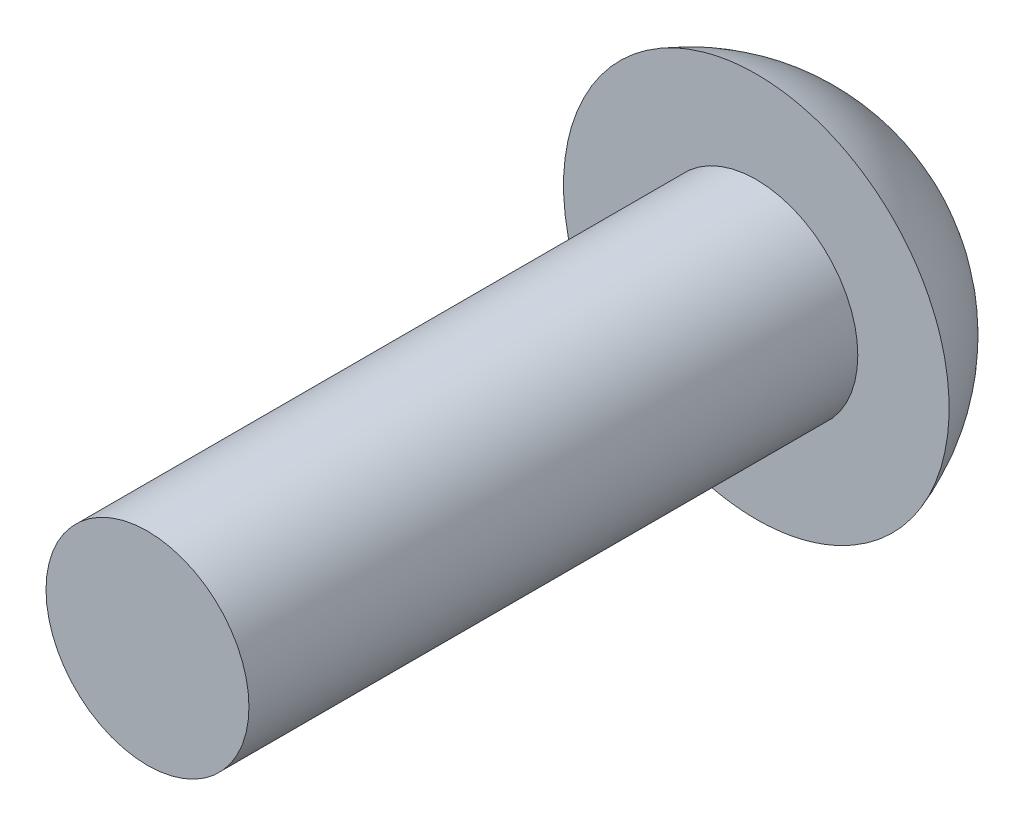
ISO-10303-21;
HEADER;
FILE_DESCRIPTION(('STEP AP214'),'2;1');
FILE_NAME('part.step','',(''),(''),'','','');
FILE_SCHEMA(('AUTOMOTIVE_DESIGN { 1 0 10303 214 1 1 1 1 }'));
ENDSEC;
DATA;
#1=APPLICATION_CONTEXT('core data for automotive mechanical design processes');
#2=APPLICATION_PROTOCOL_DEFINITION('international standard','automotive_design',2000,#1);
#3=PRODUCT_CONTEXT('',#1,'mechanical');
#4=PRODUCT('Part','Part','',(#3));
#5=PRODUCT_RELATED_PRODUCT_CATEGORY('part','',(#4));
#6=PRODUCT_DEFINITION_FORMATION('','',#4);
#7=PRODUCT_DEFINITION_CONTEXT('part definition',#1,'design');
#8=PRODUCT_DEFINITION('design','',#6,#7);
#9=PRODUCT_DEFINITION_SHAPE('','',#8);
#10=(LENGTH_UNIT() NAMED_UNIT(*) SI_UNIT(.MILLI.,.METRE.));
#11=(NAMED_UNIT(*) PLANE_ANGLE_UNIT() SI_UNIT($,.RADIAN.));
#12=(NAMED_UNIT(*) SI_UNIT($,.STERADIAN.) SOLID_ANGLE_UNIT());
#13=UNCERTAINTY_MEASURE_WITH_UNIT(LENGTH_MEASURE(1.E-05),#10,'distance_accuracy_value','');
#14=(GEOMETRIC_REPRESENTATION_CONTEXT(3) GLOBAL_UNCERTAINTY_ASSIGNED_CONTEXT((#13)) GLOBAL_UNIT_ASSIGNED_CONTEXT((#10,
#11,#12)) REPRESENTATION_CONTEXT('',''));
#15=CARTESIAN_POINT('',(0.,0.,0.));
#16=DIRECTION('',(0.,0.,1.));
#17=DIRECTION('',(1.,0.,0.));
#18=AXIS2_PLACEMENT_3D('',#15,#16,#17);
#19=CARTESIAN_POINT('',(17.7086633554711,79.2234218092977,-9.5));
#20=DIRECTION('',(0.,0.,-1.));
#21=DIRECTION('',(-1.,0.,0.));
#22=AXIS2_PLACEMENT_3D('',#19,#20,#21);
#23=PLANE('',#22);
#24=CARTESIAN_POINT('',(19.0714543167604,78.3494634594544,-9.5));
#25=DIRECTION('',(0.,0.,-1.));
#26=DIRECTION('',(0.,1.,0.));
#27=AXIS2_PLACEMENT_3D('',#24,#25,#26);
#28=CIRCLE('',#27,0.761601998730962);
#29=CARTESIAN_POINT('',(18.5018949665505,78.8550717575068,-9.5));
#30=VERTEX_POINT('',#29);
#31=CARTESIAN_POINT('',(19.6061955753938,78.8917635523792,-9.5));
#32=VERTEX_POINT('',#31);
#33=EDGE_CURVE('E107',#30,#32,#28,.T.);
#34=ORIENTED_EDGE('',*,*,#33,.F.);
#35=CARTESIAN_POINT('',(18.2440188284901,79.0839931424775,-9.5));
#36=DIRECTION('',(0.,0.,-1.));
#37=DIRECTION('',(0.,1.,0.));
#38=AXIS2_PLACEMENT_3D('',#35,#36,#37);
#39=CIRCLE('',#38,0.344826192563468);
#40=CARTESIAN_POINT('',(17.9103241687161,79.1709010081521,-9.5));
#41=VERTEX_POINT('',#40);
#42=EDGE_CURVE('E142',#30,#41,#39,.T.);
#43=ORIENTED_EDGE('',*,*,#42,.T.);
#44=CARTESIAN_POINT('',(17.1733078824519,79.3628504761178,-9.5));
#45=DIRECTION('',(0.,0.,-1.));
#46=DIRECTION('',(0.,1.,0.));
#47=AXIS2_PLACEMENT_3D('',#44,#45,#46);
#48=CIRCLE('',#47,0.761601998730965);
#49=CARTESIAN_POINT('',(17.3263978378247,80.1089074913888,-9.5));
#50=VERTEX_POINT('',#49);
#51=EDGE_CURVE('E182',#50,#41,#48,.T.);
#52=ORIENTED_EDGE('',*,*,#51,.F.);
#53=CARTESIAN_POINT('',(17.3957115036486,80.4466954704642,-9.5));
#54=DIRECTION('',(0.,0.,-1.));
#55=DIRECTION('',(0.,1.,0.));
#56=AXIS2_PLACEMENT_3D('',#53,#54,#55);
#57=CIRCLE('',#56,0.344826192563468);
#58=CARTESIAN_POINT('',(17.3041285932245,80.779137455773,-9.5));
#59=VERTEX_POINT('',#58);
#60=EDGE_CURVE('E189',#50,#59,#57,.T.);
#61=ORIENTED_EDGE('',*,*,#60,.T.);
#62=CARTESIAN_POINT('',(17.1018535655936,81.5133870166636,-9.5));
#63=DIRECTION('',(0.,0.,-1.));
#64=DIRECTION('',(0.,1.,0.));
#65=AXIS2_PLACEMENT_3D('',#62,#63,#64);
#66=CIRCLE('',#65,0.761601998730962);
#67=CARTESIAN_POINT('',(17.8245028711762,81.753835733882,-9.5));
#68=VERTEX_POINT('',#67);
#69=EDGE_CURVE('E143',#68,#59,#66,.T.);
#70=ORIENTED_EDGE('',*,*,#69,.F.);
#71=CARTESIAN_POINT('',(18.1516926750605,81.8627023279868,-9.5));
#72=DIRECTION('',(0.,0.,-1.));
#73=DIRECTION('',(0.,1.,0.));
#74=AXIS2_PLACEMENT_3D('',#71,#72,#73);
#75=CIRCLE('',#74,0.344826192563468);
#76=CARTESIAN_POINT('',(18.3938044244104,82.108236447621,-9.5));
#77=VERTEX_POINT('',#76);
#78=EDGE_CURVE('E195',#68,#77,#75,.T.);
#79=ORIENTED_EDGE('',*,*,#78,.T.);
#80=CARTESIAN_POINT('',(18.9285456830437,82.6505365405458,-9.5));
#81=DIRECTION('',(0.,0.,-1.));
#82=DIRECTION('',(0.,1.,0.));
#83=AXIS2_PLACEMENT_3D('',#80,#81,#82);
#84=CIRCLE('',#83,0.761601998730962);
#85=CARTESIAN_POINT('',(19.4981050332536,82.1449282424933,-9.5));
#86=VERTEX_POINT('',#85);
#87=EDGE_CURVE('E197',#86,#77,#84,.T.);
#88=ORIENTED_EDGE('',*,*,#87,.F.);
#89=CARTESIAN_POINT('',(19.7559811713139,81.9160068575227,-9.5));
#90=DIRECTION('',(0.,0.,-1.));
#91=DIRECTION('',(0.,1.,0.));
#92=AXIS2_PLACEMENT_3D('',#89,#90,#91);
#93=CIRCLE('',#92,0.344826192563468);
#94=CARTESIAN_POINT('',(20.089675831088,81.8290989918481,-9.5));
#95=VERTEX_POINT('',#94);
#96=EDGE_CURVE('E104',#86,#95,#93,.T.);
#97=ORIENTED_EDGE('',*,*,#96,.T.);
#98=CARTESIAN_POINT('',(20.8266921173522,81.6371495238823,-9.5));
#99=DIRECTION('',(0.,0.,-1.));
#100=DIRECTION('',(0.,1.,0.));
#101=AXIS2_PLACEMENT_3D('',#98,#99,#100);
#102=CIRCLE('',#101,0.761601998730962);
#103=CARTESIAN_POINT('',(20.6736021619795,80.8910925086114,-9.5));
#104=VERTEX_POINT('',#103);
#105=EDGE_CURVE('E19',#104,#95,#102,.T.);
#106=ORIENTED_EDGE('',*,*,#105,.F.);
#107=CARTESIAN_POINT('',(20.6042884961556,80.5533045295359,-9.5));
#108=DIRECTION('',(0.,0.,-1.));
#109=DIRECTION('',(0.,1.,0.));
#110=AXIS2_PLACEMENT_3D('',#107,#108,#109);
#111=CIRCLE('',#110,0.344826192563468);
#112=CARTESIAN_POINT('',(20.6958714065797,80.2208625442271,-9.5));
#113=VERTEX_POINT('',#112);
#114=EDGE_CURVE('E101',#104,#113,#111,.T.);
#115=ORIENTED_EDGE('',*,*,#114,.T.);
#116=CARTESIAN_POINT('',(20.8981464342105,79.4866129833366,-9.5));
#117=DIRECTION('',(0.,0.,-1.));
#118=DIRECTION('',(0.,1.,0.));
#119=AXIS2_PLACEMENT_3D('',#116,#117,#118);
#120=CIRCLE('',#119,0.761601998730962);
#121=CARTESIAN_POINT('',(20.175497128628,79.2461642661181,-9.5));
#122=VERTEX_POINT('',#121);
#123=EDGE_CURVE('E128',#122,#113,#120,.T.);
#124=ORIENTED_EDGE('',*,*,#123,.F.);
#125=CARTESIAN_POINT('',(19.8483073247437,79.1372976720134,-9.5));
#126=DIRECTION('',(0.,0.,-1.));
#127=DIRECTION('',(0.,1.,0.));
#128=AXIS2_PLACEMENT_3D('',#125,#126,#127);
#129=CIRCLE('',#128,0.344826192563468);
#130=EDGE_CURVE('E123',#122,#32,#129,.T.);
#131=ORIENTED_EDGE('',*,*,#130,.T.);
#132=EDGE_LOOP('',(#34,#43,#52,#61,#70,#79,#88,#97,#106,#115,#124,#131));
#133=FACE_BOUND('',#132,.T.);
#134=ADVANCED_FACE('F16',(#133),#23,.T.);
#135=CARTESIAN_POINT('',(20.8266921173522,81.6371495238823,-9.5));
#136=DIRECTION('',(0.,0.,-1.));
#137=DIRECTION('',(0.,1.,0.));
#138=AXIS2_PLACEMENT_3D('',#135,#136,#137);
#139=CYLINDRICAL_SURFACE('',#138,0.761601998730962);
#140=ORIENTED_EDGE('',*,*,#105,.T.);
#141=DIRECTION('',(0.,0.,-1.));
#142=VECTOR('',#141,1.);
#143=CARTESIAN_POINT('',(20.089675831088,81.8290989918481,-9.5));
#144=LINE('',#143,#142);
#145=CARTESIAN_POINT('',(20.089675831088,81.8290989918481,-10.3));
#146=VERTEX_POINT('',#145);
#147=EDGE_CURVE('E145',#95,#146,#144,.T.);
#148=ORIENTED_EDGE('',*,*,#147,.T.);
#149=CARTESIAN_POINT('',(20.8266921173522,81.6371495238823,-10.3));
#150=DIRECTION('',(0.,0.,-1.));
#151=DIRECTION('',(0.,1.,0.));
#152=AXIS2_PLACEMENT_3D('',#149,#150,#151);
#153=CIRCLE('',#152,0.761601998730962);
#154=CARTESIAN_POINT('',(20.6736021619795,80.8910925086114,-10.3));
#155=VERTEX_POINT('',#154);
#156=EDGE_CURVE('E112',#155,#146,#153,.T.);
#157=ORIENTED_EDGE('',*,*,#156,.F.);
#158=DIRECTION('',(0.,0.,-1.));
#159=VECTOR('',#158,1.);
#160=CARTESIAN_POINT('',(20.6736021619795,80.8910925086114,-9.5));
#161=LINE('',#160,#159);
#162=EDGE_CURVE('E109',#155,#104,#161,.F.);
#163=ORIENTED_EDGE('',*,*,#162,.T.);
#164=EDGE_LOOP('',(#140,#148,#157,#163));
#165=FACE_BOUND('',#164,.T.);
#166=ADVANCED_FACE('F110',(#165),#139,.T.);
#167=CARTESIAN_POINT('',(19.0714543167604,78.3494634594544,-9.5));
#168=DIRECTION('',(0.,0.,-1.));
#169=DIRECTION('',(0.,1.,0.));
#170=AXIS2_PLACEMENT_3D('',#167,#168,#169);
#171=CYLINDRICAL_SURFACE('',#170,0.761601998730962);
#172=ORIENTED_EDGE('',*,*,#33,.T.);
#173=DIRECTION('',(0.,0.,-1.));
#174=VECTOR('',#173,1.);
#175=CARTESIAN_POINT('',(19.6061955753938,78.8917635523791,-9.5));
#176=LINE('',#175,#174);
#177=CARTESIAN_POINT('',(19.6061955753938,78.8917635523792,-10.3));
#178=VERTEX_POINT('',#177);
#179=EDGE_CURVE('E121',#32,#178,#176,.T.);
#180=ORIENTED_EDGE('',*,*,#179,.T.);
#181=CARTESIAN_POINT('',(19.0714543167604,78.3494634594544,-10.3));
#182=DIRECTION('',(0.,0.,-1.));
#183=DIRECTION('',(0.,1.,0.));
#184=AXIS2_PLACEMENT_3D('',#181,#182,#183);
#185=CIRCLE('',#184,0.761601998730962);
#186=CARTESIAN_POINT('',(18.5018949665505,78.8550717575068,-10.3));
#187=VERTEX_POINT('',#186);
#188=EDGE_CURVE('E215',#187,#178,#185,.T.);
#189=ORIENTED_EDGE('',*,*,#188,.F.);
#190=DIRECTION('',(0.,0.,-1.));
#191=VECTOR('',#190,1.);
#192=CARTESIAN_POINT('',(18.5018949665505,78.8550717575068,-9.5));
#193=LINE('',#192,#191);
#194=EDGE_CURVE('E141',#187,#30,#193,.F.);
#195=ORIENTED_EDGE('',*,*,#194,.T.);
#196=EDGE_LOOP('',(#172,#180,#189,#195));
#197=FACE_BOUND('',#196,.T.);
#198=ADVANCED_FACE('F214',(#197),#171,.T.);
#199=CARTESIAN_POINT('',(20.8981464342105,79.4866129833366,-9.5));
#200=DIRECTION('',(0.,0.,-1.));
#201=DIRECTION('',(0.,1.,0.));
#202=AXIS2_PLACEMENT_3D('',#199,#200,#201);
#203=CYLINDRICAL_SURFACE('',#202,0.761601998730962);
#204=ORIENTED_EDGE('',*,*,#123,.T.);
#205=DIRECTION('',(0.,0.,-1.));
#206=VECTOR('',#205,1.);
#207=CARTESIAN_POINT('',(20.6958714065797,80.2208625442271,-9.5));
#208=LINE('',#207,#206);
#209=CARTESIAN_POINT('',(20.6958714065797,80.2208625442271,-10.3));
#210=VERTEX_POINT('',#209);
#211=EDGE_CURVE('E115',#113,#210,#208,.T.);
#212=ORIENTED_EDGE('',*,*,#211,.T.);
#213=CARTESIAN_POINT('',(20.8981464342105,79.4866129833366,-10.3));
#214=DIRECTION('',(0.,0.,-1.));
#215=DIRECTION('',(0.,1.,0.));
#216=AXIS2_PLACEMENT_3D('',#213,#214,#215);
#217=CIRCLE('',#216,0.761601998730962);
#218=CARTESIAN_POINT('',(20.175497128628,79.2461642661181,-10.3));
#219=VERTEX_POINT('',#218);
#220=EDGE_CURVE('E218',#219,#210,#217,.T.);
#221=ORIENTED_EDGE('',*,*,#220,.F.);
#222=DIRECTION('',(0.,0.,-1.));
#223=VECTOR('',#222,1.);
#224=CARTESIAN_POINT('',(20.175497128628,79.2461642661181,-9.5));
#225=LINE('',#224,#223);
#226=EDGE_CURVE('E129',#219,#122,#225,.F.);
#227=ORIENTED_EDGE('',*,*,#226,.T.);
#228=EDGE_LOOP('',(#204,#212,#221,#227));
#229=FACE_BOUND('',#228,.T.);
#230=ADVANCED_FACE('F292',(#229),#203,.T.);
#231=CARTESIAN_POINT('',(20.6042884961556,80.5533045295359,-9.5));
#232=DIRECTION('',(0.,0.,-1.));
#233=DIRECTION('',(0.,1.,0.));
#234=AXIS2_PLACEMENT_3D('',#231,#232,#233);
#235=CYLINDRICAL_SURFACE('',#234,0.344826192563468);
#236=ORIENTED_EDGE('',*,*,#114,.F.);
#237=ORIENTED_EDGE('',*,*,#162,.F.);
#238=CARTESIAN_POINT('',(20.6042884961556,80.5533045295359,-10.3));
#239=DIRECTION('',(0.,0.,-1.));
#240=DIRECTION('',(0.,1.,0.));
#241=AXIS2_PLACEMENT_3D('',#238,#239,#240);
#242=CIRCLE('',#241,0.344826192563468);
#243=CARTESIAN_POINT('',(20.948924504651,80.564755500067,-10.3));
#244=VERTEX_POINT('',#243);
#245=EDGE_CURVE('E181',#244,#155,#242,.F.);
#246=ORIENTED_EDGE('',*,*,#245,.F.);
#247=CARTESIAN_POINT('',(20.6042884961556,80.5533045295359,-10.3));
#248=DIRECTION('',(0.,0.,-1.));
#249=DIRECTION('',(0.,1.,0.));
#250=AXIS2_PLACEMENT_3D('',#247,#248,#249);
#251=CIRCLE('',#250,0.344826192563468);
#252=EDGE_CURVE('E283',#210,#244,#251,.F.);
#253=ORIENTED_EDGE('',*,*,#252,.F.);
#254=ORIENTED_EDGE('',*,*,#211,.F.);
#255=EDGE_LOOP('',(#236,#237,#246,#253,#254));
#256=FACE_BOUND('',#255,.T.);
#257=ADVANCED_FACE('F118',(#256),#235,.F.);
#258=CARTESIAN_POINT('',(19.8483073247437,79.1372976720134,-9.5));
#259=DIRECTION('',(0.,0.,-1.));
#260=DIRECTION('',(0.,1.,0.));
#261=AXIS2_PLACEMENT_3D('',#258,#259,#260);
#262=CYLINDRICAL_SURFACE('',#261,0.344826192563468);
#263=ORIENTED_EDGE('',*,*,#130,.F.);
#264=ORIENTED_EDGE('',*,*,#226,.F.);
#265=CARTESIAN_POINT('',(19.8483073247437,79.1372976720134,-10.3));
#266=DIRECTION('',(0.,0.,-1.));
#267=DIRECTION('',(0.,1.,0.));
#268=AXIS2_PLACEMENT_3D('',#265,#266,#267);
#269=CIRCLE('',#268,0.344826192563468);
#270=CARTESIAN_POINT('',(20.0305421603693,78.8445596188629,-10.3));
#271=VERTEX_POINT('',#270);
#272=EDGE_CURVE('E280',#271,#219,#269,.F.);
#273=ORIENTED_EDGE('',*,*,#272,.F.);
#274=CARTESIAN_POINT('',(19.8483073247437,79.1372976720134,-10.3));
#275=DIRECTION('',(0.,0.,-1.));
#276=DIRECTION('',(0.,1.,0.));
#277=AXIS2_PLACEMENT_3D('',#274,#275,#276);
#278=CIRCLE('',#277,0.344826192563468);
#279=EDGE_CURVE('E211',#178,#271,#278,.F.);
#280=ORIENTED_EDGE('',*,*,#279,.F.);
#281=ORIENTED_EDGE('',*,*,#179,.F.);
#282=EDGE_LOOP('',(#263,#264,#273,#280,#281));
#283=FACE_BOUND('',#282,.T.);
#284=ADVANCED_FACE('F209',(#283),#262,.F.);
#285=CARTESIAN_POINT('',(19.7559811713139,81.9160068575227,-9.5));
#286=DIRECTION('',(0.,0.,-1.));
#287=DIRECTION('',(0.,1.,0.));
#288=AXIS2_PLACEMENT_3D('',#285,#286,#287);
#289=CYLINDRICAL_SURFACE('',#288,0.344826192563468);
#290=CARTESIAN_POINT('',(19.7559811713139,81.9160068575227,-10.3));
#291=DIRECTION('',(0.,0.,-1.));
#292=DIRECTION('',(0.,1.,0.));
#293=AXIS2_PLACEMENT_3D('',#290,#291,#292);
#294=CIRCLE('',#293,0.344826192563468);
#295=CARTESIAN_POINT('',(19.9183823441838,82.2201958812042,-10.3));
#296=VERTEX_POINT('',#295);
#297=EDGE_CURVE('E225',#146,#296,#294,.F.);
#298=ORIENTED_EDGE('',*,*,#297,.F.);
#299=ORIENTED_EDGE('',*,*,#147,.F.);
#300=ORIENTED_EDGE('',*,*,#96,.F.);
#301=DIRECTION('',(0.,0.,-1.));
#302=VECTOR('',#301,1.);
#303=CARTESIAN_POINT('',(19.4981050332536,82.1449282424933,-9.5));
#304=LINE('',#303,#302);
#305=CARTESIAN_POINT('',(19.4981050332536,82.1449282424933,-10.3));
#306=VERTEX_POINT('',#305);
#307=EDGE_CURVE('E146',#306,#86,#304,.F.);
#308=ORIENTED_EDGE('',*,*,#307,.F.);
#309=CARTESIAN_POINT('',(19.7559811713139,81.9160068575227,-10.3));
#310=DIRECTION('',(0.,0.,-1.));
#311=DIRECTION('',(0.,1.,0.));
#312=AXIS2_PLACEMENT_3D('',#309,#310,#311);
#313=CIRCLE('',#312,0.344826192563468);
#314=EDGE_CURVE('E277',#296,#306,#313,.F.);
#315=ORIENTED_EDGE('',*,*,#314,.F.);
#316=EDGE_LOOP('',(#298,#299,#300,#308,#315));
#317=FACE_BOUND('',#316,.T.);
#318=ADVANCED_FACE('F440',(#317),#289,.F.);
#319=CARTESIAN_POINT('',(18.9285456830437,82.6505365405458,-9.5));
#320=DIRECTION('',(0.,0.,-1.));
#321=DIRECTION('',(0.,1.,0.));
#322=AXIS2_PLACEMENT_3D('',#319,#320,#321);
#323=CYLINDRICAL_SURFACE('',#322,0.761601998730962);
#324=ORIENTED_EDGE('',*,*,#87,.T.);
#325=DIRECTION('',(0.,0.,-1.));
#326=VECTOR('',#325,1.);
#327=CARTESIAN_POINT('',(18.3938044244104,82.108236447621,-9.5));
#328=LINE('',#327,#326);
#329=CARTESIAN_POINT('',(18.3938044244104,82.108236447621,-10.3));
#330=VERTEX_POINT('',#329);
#331=EDGE_CURVE('E193',#77,#330,#328,.T.);
#332=ORIENTED_EDGE('',*,*,#331,.T.);
#333=CARTESIAN_POINT('',(18.9285456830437,82.6505365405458,-10.3));
#334=DIRECTION('',(0.,0.,-1.));
#335=DIRECTION('',(0.,1.,0.));
#336=AXIS2_PLACEMENT_3D('',#333,#334,#335);
#337=CIRCLE('',#336,0.761601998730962);
#338=EDGE_CURVE('E274',#306,#330,#337,.T.);
#339=ORIENTED_EDGE('',*,*,#338,.F.);
#340=ORIENTED_EDGE('',*,*,#307,.T.);
#341=EDGE_LOOP('',(#324,#332,#339,#340));
#342=FACE_BOUND('',#341,.T.);
#343=ADVANCED_FACE('F431',(#342),#323,.T.);
#344=CARTESIAN_POINT('',(18.1516926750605,81.8627023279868,-9.5));
#345=DIRECTION('',(0.,0.,-1.));
#346=DIRECTION('',(0.,1.,0.));
#347=AXIS2_PLACEMENT_3D('',#344,#345,#346);
#348=CYLINDRICAL_SURFACE('',#347,0.344826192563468);
#349=CARTESIAN_POINT('',(18.1516926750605,81.8627023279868,-10.3));
#350=DIRECTION('',(0.,0.,-1.));
#351=DIRECTION('',(0.,1.,0.));
#352=AXIS2_PLACEMENT_3D('',#349,#350,#351);
#353=CIRCLE('',#352,0.344826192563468);
#354=CARTESIAN_POINT('',(17.9694578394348,82.1554403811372,-10.3));
#355=VERTEX_POINT('',#354);
#356=EDGE_CURVE('E268',#330,#355,#353,.F.);
#357=ORIENTED_EDGE('',*,*,#356,.F.);
#358=ORIENTED_EDGE('',*,*,#331,.F.);
#359=ORIENTED_EDGE('',*,*,#78,.F.);
#360=DIRECTION('',(0.,0.,-1.));
#361=VECTOR('',#360,1.);
#362=CARTESIAN_POINT('',(17.8245028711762,81.753835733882,-9.5));
#363=LINE('',#362,#361);
#364=CARTESIAN_POINT('',(17.8245028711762,81.753835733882,-10.3));
#365=VERTEX_POINT('',#364);
#366=EDGE_CURVE('E190',#365,#68,#363,.F.);
#367=ORIENTED_EDGE('',*,*,#366,.F.);
#368=CARTESIAN_POINT('',(18.1516926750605,81.8627023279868,-10.3));
#369=DIRECTION('',(0.,0.,-1.));
#370=DIRECTION('',(0.,1.,0.));
#371=AXIS2_PLACEMENT_3D('',#368,#369,#370);
#372=CIRCLE('',#371,0.344826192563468);
#373=EDGE_CURVE('E266',#355,#365,#372,.F.);
#374=ORIENTED_EDGE('',*,*,#373,.F.);
#375=EDGE_LOOP('',(#357,#358,#359,#367,#374));
#376=FACE_BOUND('',#375,.T.);
#377=ADVANCED_FACE('F423',(#376),#348,.F.);
#378=CARTESIAN_POINT('',(17.1018535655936,81.5133870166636,-9.5));
#379=DIRECTION('',(0.,0.,-1.));
#380=DIRECTION('',(0.,1.,0.));
#381=AXIS2_PLACEMENT_3D('',#378,#379,#380);
#382=CYLINDRICAL_SURFACE('',#381,0.761601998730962);
#383=DIRECTION('',(0.,0.,-1.));
#384=VECTOR('',#383,1.);
#385=CARTESIAN_POINT('',(17.3041285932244,80.779137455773,-9.5));
#386=LINE('',#385,#384);
#387=CARTESIAN_POINT('',(17.3041285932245,80.779137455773,-10.3));
#388=VERTEX_POINT('',#387);
#389=EDGE_CURVE('E186',#59,#388,#386,.T.);
#390=ORIENTED_EDGE('',*,*,#389,.T.);
#391=CARTESIAN_POINT('',(17.1018535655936,81.5133870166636,-10.3));
#392=DIRECTION('',(0.,0.,-1.));
#393=DIRECTION('',(0.,1.,0.));
#394=AXIS2_PLACEMENT_3D('',#391,#392,#393);
#395=CIRCLE('',#394,0.761601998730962);
#396=EDGE_CURVE('E261',#365,#388,#395,.T.);
#397=ORIENTED_EDGE('',*,*,#396,.F.);
#398=ORIENTED_EDGE('',*,*,#366,.T.);
#399=ORIENTED_EDGE('',*,*,#69,.T.);
#400=EDGE_LOOP('',(#390,#397,#398,#399));
#401=FACE_BOUND('',#400,.T.);
#402=ADVANCED_FACE('F239',(#401),#382,.T.);
#403=CARTESIAN_POINT('',(18.2440188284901,79.0839931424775,-9.5));
#404=DIRECTION('',(0.,0.,-1.));
#405=DIRECTION('',(0.,1.,0.));
#406=AXIS2_PLACEMENT_3D('',#403,#404,#405);
#407=CYLINDRICAL_SURFACE('',#406,0.344826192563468);
#408=CARTESIAN_POINT('',(18.2440188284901,79.0839931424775,-10.3));
#409=DIRECTION('',(0.,0.,-1.));
#410=DIRECTION('',(0.,1.,0.));
#411=AXIS2_PLACEMENT_3D('',#408,#409,#410);
#412=CIRCLE('',#411,0.344826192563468);
#413=CARTESIAN_POINT('',(17.9103241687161,79.1709010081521,-10.3));
#414=VERTEX_POINT('',#413);
#415=CARTESIAN_POINT('',(18.0816176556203,78.7798041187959,-10.3));
#416=VERTEX_POINT('',#415);
#417=EDGE_CURVE('E260',#414,#416,#412,.F.);
#418=ORIENTED_EDGE('',*,*,#417,.F.);
#419=DIRECTION('',(0.,0.,-1.));
#420=VECTOR('',#419,1.);
#421=CARTESIAN_POINT('',(17.9103241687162,79.1709010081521,-9.5));
#422=LINE('',#421,#420);
#423=EDGE_CURVE('E178',#41,#414,#422,.T.);
#424=ORIENTED_EDGE('',*,*,#423,.F.);
#425=ORIENTED_EDGE('',*,*,#42,.F.);
#426=ORIENTED_EDGE('',*,*,#194,.F.);
#427=CARTESIAN_POINT('',(18.2440188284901,79.0839931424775,-10.3));
#428=DIRECTION('',(0.,0.,-1.));
#429=DIRECTION('',(0.,1.,0.));
#430=AXIS2_PLACEMENT_3D('',#427,#428,#429);
#431=CIRCLE('',#430,0.344826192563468);
#432=EDGE_CURVE('E34',#416,#187,#431,.F.);
#433=ORIENTED_EDGE('',*,*,#432,.F.);
#434=EDGE_LOOP('',(#418,#424,#425,#426,#433));
#435=FACE_BOUND('',#434,.T.);
#436=ADVANCED_FACE('F408',(#435),#407,.F.);
#437=CARTESIAN_POINT('',(17.3957115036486,80.4466954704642,-9.5));
#438=DIRECTION('',(0.,0.,-1.));
#439=DIRECTION('',(0.,1.,0.));
#440=AXIS2_PLACEMENT_3D('',#437,#438,#439);
#441=CYLINDRICAL_SURFACE('',#440,0.344826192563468);
#442=CARTESIAN_POINT('',(17.3957115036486,80.4466954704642,-10.3));
#443=DIRECTION('',(0.,0.,-1.));
#444=DIRECTION('',(0.,1.,0.));
#445=AXIS2_PLACEMENT_3D('',#442,#443,#444);
#446=CIRCLE('',#445,0.344826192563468);
#447=CARTESIAN_POINT('',(17.0510754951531,80.4352444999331,-10.3));
#448=VERTEX_POINT('',#447);
#449=EDGE_CURVE('E250',#388,#448,#446,.F.);
#450=ORIENTED_EDGE('',*,*,#449,.F.);
#451=ORIENTED_EDGE('',*,*,#389,.F.);
#452=ORIENTED_EDGE('',*,*,#60,.F.);
#453=DIRECTION('',(0.,0.,-1.));
#454=VECTOR('',#453,1.);
#455=CARTESIAN_POINT('',(17.3263978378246,80.1089074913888,-9.5));
#456=LINE('',#455,#454);
#457=CARTESIAN_POINT('',(17.3263978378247,80.1089074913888,-10.3));
#458=VERTEX_POINT('',#457);
#459=EDGE_CURVE('E183',#458,#50,#456,.F.);
#460=ORIENTED_EDGE('',*,*,#459,.F.);
#461=CARTESIAN_POINT('',(17.3957115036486,80.4466954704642,-10.3));
#462=DIRECTION('',(0.,0.,-1.));
#463=DIRECTION('',(0.,1.,0.));
#464=AXIS2_PLACEMENT_3D('',#461,#462,#463);
#465=CIRCLE('',#464,0.344826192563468);
#466=EDGE_CURVE('E253',#448,#458,#465,.F.);
#467=ORIENTED_EDGE('',*,*,#466,.F.);
#468=EDGE_LOOP('',(#450,#451,#452,#460,#467));
#469=FACE_BOUND('',#468,.T.);
#470=ADVANCED_FACE('F246',(#469),#441,.F.);
#471=CARTESIAN_POINT('',(17.1733078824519,79.3628504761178,-9.5));
#472=DIRECTION('',(0.,0.,-1.));
#473=DIRECTION('',(0.,1.,0.));
#474=AXIS2_PLACEMENT_3D('',#471,#472,#473);
#475=CYLINDRICAL_SURFACE('',#474,0.761601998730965);
#476=ORIENTED_EDGE('',*,*,#51,.T.);
#477=ORIENTED_EDGE('',*,*,#423,.T.);
#478=CARTESIAN_POINT('',(17.1733078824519,79.3628504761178,-10.3));
#479=DIRECTION('',(0.,0.,-1.));
#480=DIRECTION('',(0.,1.,0.));
#481=AXIS2_PLACEMENT_3D('',#478,#479,#480);
#482=CIRCLE('',#481,0.761601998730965);
#483=EDGE_CURVE('E542',#458,#414,#482,.T.);
#484=ORIENTED_EDGE('',*,*,#483,.F.);
#485=ORIENTED_EDGE('',*,*,#459,.T.);
#486=EDGE_LOOP('',(#476,#477,#484,#485));
#487=FACE_BOUND('',#486,.T.);
#488=ADVANCED_FACE('F391',(#487),#475,.T.);
#489=CARTESIAN_POINT('',(18.9999999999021,80.5,-10.3));
#490=DIRECTION('',(0.,0.,-1.));
#491=DIRECTION('',(0.,1.,0.));
#492=AXIS2_PLACEMENT_3D('',#489,#490,#491);
#493=PLANE('',#492);
#494=ORIENTED_EDGE('',*,*,#297,.T.);
#495=CARTESIAN_POINT('',(20.948924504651,80.564755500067,-10.3));
#496=CARTESIAN_POINT('',(20.9471010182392,80.6196172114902,-10.3));
#497=CARTESIAN_POINT('',(20.9429616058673,80.6743752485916,-10.3));
#498=CARTESIAN_POINT('',(20.9300852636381,80.7833451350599,-10.3));
#499=CARTESIAN_POINT('',(20.9213485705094,80.8375570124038,-10.3));
#500=CARTESIAN_POINT('',(20.8883528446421,80.9985836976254,-10.3));
#501=CARTESIAN_POINT('',(20.8572978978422,81.1040890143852,-10.3));
#502=CARTESIAN_POINT('',(20.7779239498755,81.3084130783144,-10.3));
#503=CARTESIAN_POINT('',(20.7295911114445,81.4072263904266,-10.3));
#504=CARTESIAN_POINT('',(20.6169664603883,81.5954099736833,-10.3));
#505=CARTESIAN_POINT('',(20.5526709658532,81.6847780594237,-10.3));
#506=CARTESIAN_POINT('',(20.4420947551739,81.8139756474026,-10.3));
#507=CARTESIAN_POINT('',(20.4006631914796,81.858050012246,-10.3));
#508=CARTESIAN_POINT('',(20.3138724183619,81.9421814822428,-10.3));
#509=CARTESIAN_POINT('',(20.2685127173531,81.9822380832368,-10.3));
#510=CARTESIAN_POINT('',(20.1741445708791,82.0580621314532,-10.3));
#511=CARTESIAN_POINT('',(20.1251266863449,82.0938178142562,-10.3));
#512=CARTESIAN_POINT('',(20.0239802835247,82.1606159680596,-10.3));
#513=CARTESIAN_POINT('',(19.9718518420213,82.1916585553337,-10.3));
#514=CARTESIAN_POINT('',(19.9183823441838,82.2201958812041,-10.3));
#515=B_SPLINE_CURVE_WITH_KNOTS('',3,(#495,#496,#497,#498,#499,#500,#501,#502,#503,#504,#505,
#506,#507,#508,#509,#510,#511,#512,#513,#514),.UNSPECIFIED.,.F.,.F.,(4,2,2,2,2,2,2,2,2,4),(0.,
0.164573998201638,0.329139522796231,0.657383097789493,0.985890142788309,1.31447303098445,
1.49572297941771,1.67699564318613,1.85875338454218,2.04050664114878),.UNSPECIFIED.);
#516=EDGE_CURVE('E535',#244,#296,#515,.T.);
#517=ORIENTED_EDGE('',*,*,#516,.F.);
#518=ORIENTED_EDGE('',*,*,#245,.T.);
#519=ORIENTED_EDGE('',*,*,#156,.T.);
#520=EDGE_LOOP('',(#494,#517,#518,#519));
#521=FACE_BOUND('',#520,.T.);
#522=ADVANCED_FACE('F383',(#521),#493,.T.);
#523=CARTESIAN_POINT('',(18.9999999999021,80.5,-10.3));
#524=DIRECTION('',(0.,0.,-1.));
#525=DIRECTION('',(0.,1.,0.));
#526=AXIS2_PLACEMENT_3D('',#523,#524,#525);
#527=PLANE('',#526);
#528=ORIENTED_EDGE('',*,*,#432,.T.);
#529=ORIENTED_EDGE('',*,*,#188,.T.);
#530=ORIENTED_EDGE('',*,*,#279,.T.);
#531=CARTESIAN_POINT('',(18.0816176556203,78.7798041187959,-10.3));
#532=CARTESIAN_POINT('',(18.1300410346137,78.7539524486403,-10.2999999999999));
#533=CARTESIAN_POINT('',(18.1795325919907,78.7301582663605,-10.2999999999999));
#534=CARTESIAN_POINT('',(18.2803414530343,78.6868245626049,-10.3000000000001));
#535=CARTESIAN_POINT('',(18.3316586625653,78.6672848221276,-10.3000000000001));
#536=CARTESIAN_POINT('',(18.4876097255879,78.6153466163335,-10.2999999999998));
#537=CARTESIAN_POINT('',(18.5945074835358,78.5894883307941,-10.299999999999));
#538=CARTESIAN_POINT('',(18.8111442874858,78.5560661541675,-10.2999999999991));
#539=CARTESIAN_POINT('',(18.9208855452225,78.5485169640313,-10.3));
#540=CARTESIAN_POINT('',(19.1401696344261,78.5519609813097,-10.3));
#541=CARTESIAN_POINT('',(19.2497124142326,78.5629584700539,-10.299999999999));
#542=CARTESIAN_POINT('',(19.4168889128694,78.5941214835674,-10.2999999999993));
#543=CARTESIAN_POINT('',(19.4757742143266,78.6079650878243,-10.2999999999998));
#544=CARTESIAN_POINT('',(19.5920295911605,78.6410623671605,-10.3000000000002));
#545=CARTESIAN_POINT('',(19.6493994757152,78.6603167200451,-10.3000000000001));
#546=CARTESIAN_POINT('',(19.7622491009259,78.7041299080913,-10.2999999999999));
#547=CARTESIAN_POINT('',(19.8177233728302,78.7287027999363,-10.3));
#548=CARTESIAN_POINT('',(19.9261454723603,78.7828990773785,-10.3));
#549=CARTESIAN_POINT('',(19.9790933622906,78.8125223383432,-10.3000000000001));
#550=CARTESIAN_POINT('',(20.0305421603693,78.8445596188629,-10.3));
#551=B_SPLINE_CURVE_WITH_KNOTS('',3,(#531,#532,#533,#534,#535,#536,#537,#538,#539,#540,#541,
#542,#543,#544,#545,#546,#547,#548,#549,#550),.UNSPECIFIED.,.F.,.F.,(4,2,2,2,2,2,2,2,2,4),(0.,
0.164573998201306,0.32913952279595,0.657383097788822,0.985890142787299,1.31447303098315,
1.49572297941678,1.67699564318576,1.85875338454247,2.04050664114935),.UNSPECIFIED.);
#552=EDGE_CURVE('E222',#416,#271,#551,.T.);
#553=ORIENTED_EDGE('',*,*,#552,.F.);
#554=EDGE_LOOP('',(#528,#529,#530,#553));
#555=FACE_BOUND('',#554,.T.);
#556=ADVANCED_FACE('F220',(#555),#527,.T.);
#557=CARTESIAN_POINT('',(18.9999999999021,80.5,-10.3));
#558=DIRECTION('',(0.,0.,-1.));
#559=DIRECTION('',(0.,1.,0.));
#560=AXIS2_PLACEMENT_3D('',#557,#558,#559);
#561=PLANE('',#560);
#562=CARTESIAN_POINT('',(20.0305421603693,78.8445596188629,-10.3));
#563=CARTESIAN_POINT('',(20.0771420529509,78.8735696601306,-10.3));
#564=CARTESIAN_POINT('',(20.1224941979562,78.9045335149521,-10.3));
#565=CARTESIAN_POINT('',(20.2104267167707,78.9701696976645,-10.3));
#566=CARTESIAN_POINT('',(20.2530072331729,79.004841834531,-10.3));
#567=CARTESIAN_POINT('',(20.3759625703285,79.1139303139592,-10.3));
#568=CARTESIAN_POINT('',(20.4518053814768,79.193577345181,-10.3));
#569=CARTESIAN_POINT('',(20.5890682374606,79.3644792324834,-10.3));
#570=CARTESIAN_POINT('',(20.6504766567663,79.4557433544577,-10.3));
#571=CARTESIAN_POINT('',(20.7571360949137,79.6473709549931,-10.3));
#572=CARTESIAN_POINT('',(20.802383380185,79.7477365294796,-10.3));
#573=CARTESIAN_POINT('',(20.8589836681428,79.9080971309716,-10.3));
#574=CARTESIAN_POINT('',(20.8764374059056,79.966015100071,-10.3));
#575=CARTESIAN_POINT('',(20.9059020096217,80.0832438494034,-10.3));
#576=CARTESIAN_POINT('',(20.9179121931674,80.1425548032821,-10.3));
#577=CARTESIAN_POINT('',(20.9363936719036,80.2621920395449,-10.3));
#578=CARTESIAN_POINT('',(20.9428500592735,80.3225206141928,-10.3));
#579=CARTESIAN_POINT('',(20.9501257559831,80.4435150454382,-10.3));
#580=CARTESIAN_POINT('',(20.9509452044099,80.5041808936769,-10.3));
#581=CARTESIAN_POINT('',(20.948924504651,80.564755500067,-10.3));
#582=B_SPLINE_CURVE_WITH_KNOTS('',3,(#562,#563,#564,#565,#566,#567,#568,#569,#570,#571,#572,
#573,#574,#575,#576,#577,#578,#579,#580,#581),.UNSPECIFIED.,.F.,.F.,(4,2,2,2,2,2,2,2,2,4),(0.,
0.164573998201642,0.329139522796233,0.657383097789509,0.985890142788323,1.31447303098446,
1.49572297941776,1.67699564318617,1.85875338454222,2.04050664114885),.UNSPECIFIED.);
#583=EDGE_CURVE('E556',#271,#244,#582,.T.);
#584=ORIENTED_EDGE('',*,*,#583,.F.);
#585=ORIENTED_EDGE('',*,*,#272,.T.);
#586=ORIENTED_EDGE('',*,*,#220,.T.);
#587=ORIENTED_EDGE('',*,*,#252,.T.);
#588=EDGE_LOOP('',(#584,#585,#586,#587));
#589=FACE_BOUND('',#588,.T.);
#590=ADVANCED_FACE('F289',(#589),#561,.T.);
#591=CARTESIAN_POINT('',(18.9999999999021,80.5,-10.3));
#592=DIRECTION('',(0.,0.,-1.));
#593=DIRECTION('',(0.,1.,0.));
#594=AXIS2_PLACEMENT_3D('',#591,#592,#593);
#595=PLANE('',#594);
#596=ORIENTED_EDGE('',*,*,#356,.T.);
#597=CARTESIAN_POINT('',(19.9183823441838,82.2201958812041,-10.3));
#598=CARTESIAN_POINT('',(19.8699589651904,82.2460475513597,-10.2999999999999));
#599=CARTESIAN_POINT('',(19.8204674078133,82.2698417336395,-10.2999999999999));
#600=CARTESIAN_POINT('',(19.7196585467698,82.3131754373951,-10.3000000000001));
#601=CARTESIAN_POINT('',(19.6683413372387,82.3327151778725,-10.3000000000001));
#602=CARTESIAN_POINT('',(19.5123902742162,82.3846533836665,-10.2999999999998));
#603=CARTESIAN_POINT('',(19.4054925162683,82.4105116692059,-10.299999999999));
#604=CARTESIAN_POINT('',(19.1888557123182,82.4439338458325,-10.2999999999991));
#605=CARTESIAN_POINT('',(19.0791144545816,82.4514830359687,-10.3));
#606=CARTESIAN_POINT('',(18.8598303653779,82.4480390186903,-10.3));
#607=CARTESIAN_POINT('',(18.7502875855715,82.4370415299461,-10.299999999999));
#608=CARTESIAN_POINT('',(18.5831110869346,82.4058785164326,-10.2999999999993));
#609=CARTESIAN_POINT('',(18.5242257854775,82.3920349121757,-10.2999999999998));
#610=CARTESIAN_POINT('',(18.4079704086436,82.3589376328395,-10.3000000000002));
#611=CARTESIAN_POINT('',(18.3506005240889,82.3396832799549,-10.3000000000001));
#612=CARTESIAN_POINT('',(18.2377508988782,82.2958700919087,-10.2999999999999));
#613=CARTESIAN_POINT('',(18.1822766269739,82.2712972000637,-10.3));
#614=CARTESIAN_POINT('',(18.0738545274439,82.2171009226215,-10.3));
#615=CARTESIAN_POINT('',(18.0209066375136,82.1874776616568,-10.3000000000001));
#616=CARTESIAN_POINT('',(17.9694578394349,82.1554403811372,-10.3));
#617=B_SPLINE_CURVE_WITH_KNOTS('',3,(#597,#598,#599,#600,#601,#602,#603,#604,#605,#606,#607,
#608,#609,#610,#611,#612,#613,#614,#615,#616),.UNSPECIFIED.,.F.,.F.,(4,2,2,2,2,2,2,2,2,4),(0.,
0.164573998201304,0.329139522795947,0.657383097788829,0.98589014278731,1.31447303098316,
1.49572297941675,1.67699564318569,1.85875338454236,2.04050664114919),.UNSPECIFIED.);
#618=EDGE_CURVE('E555',#296,#355,#617,.T.);
#619=ORIENTED_EDGE('',*,*,#618,.F.);
#620=ORIENTED_EDGE('',*,*,#314,.T.);
#621=ORIENTED_EDGE('',*,*,#338,.T.);
#622=EDGE_LOOP('',(#596,#619,#620,#621));
#623=FACE_BOUND('',#622,.T.);
#624=ADVANCED_FACE('F361',(#623),#595,.T.);
#625=CARTESIAN_POINT('',(18.9999999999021,80.5,-10.3));
#626=DIRECTION('',(0.,0.,-1.));
#627=DIRECTION('',(0.,1.,0.));
#628=AXIS2_PLACEMENT_3D('',#625,#626,#627);
#629=PLANE('',#628);
#630=ORIENTED_EDGE('',*,*,#449,.T.);
#631=CARTESIAN_POINT('',(17.9694578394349,82.1554403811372,-10.3));
#632=CARTESIAN_POINT('',(17.9228579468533,82.1264303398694,-10.3));
#633=CARTESIAN_POINT('',(17.877505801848,82.0954664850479,-10.3));
#634=CARTESIAN_POINT('',(17.7895732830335,82.0298303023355,-10.3));
#635=CARTESIAN_POINT('',(17.7469927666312,81.9951581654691,-10.3));
#636=CARTESIAN_POINT('',(17.6240374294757,81.8860696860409,-10.3));
#637=CARTESIAN_POINT('',(17.5481946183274,81.8064226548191,-10.3));
#638=CARTESIAN_POINT('',(17.4109317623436,81.6355207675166,-10.3));
#639=CARTESIAN_POINT('',(17.3495233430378,81.5442566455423,-10.3));
#640=CARTESIAN_POINT('',(17.2428639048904,81.352629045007,-10.3));
#641=CARTESIAN_POINT('',(17.1976166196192,81.2522634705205,-10.3));
#642=CARTESIAN_POINT('',(17.1410163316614,81.0919028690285,-10.3));
#643=CARTESIAN_POINT('',(17.1235625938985,81.0339848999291,-10.3));
#644=CARTESIAN_POINT('',(17.0940979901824,80.9167561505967,-10.3));
#645=CARTESIAN_POINT('',(17.0820878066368,80.857445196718,-10.3));
#646=CARTESIAN_POINT('',(17.0636063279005,80.7378079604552,-10.3));
#647=CARTESIAN_POINT('',(17.0571499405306,80.6774793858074,-10.3));
#648=CARTESIAN_POINT('',(17.049874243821,80.5564849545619,-10.3));
#649=CARTESIAN_POINT('',(17.0490547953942,80.4958191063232,-10.3));
#650=CARTESIAN_POINT('',(17.0510754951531,80.4352444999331,-10.3));
#651=B_SPLINE_CURVE_WITH_KNOTS('',3,(#631,#632,#633,#634,#635,#636,#637,#638,#639,#640,#641,
#642,#643,#644,#645,#646,#647,#648,#649,#650),.UNSPECIFIED.,.F.,.F.,(4,2,2,2,2,2,2,2,2,4),(0.,
0.164573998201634,0.329139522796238,0.657383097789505,0.985890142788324,1.31447303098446,
1.49572297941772,1.67699564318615,1.85875338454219,2.04050664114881),.UNSPECIFIED.);
#652=EDGE_CURVE('E554',#355,#448,#651,.T.);
#653=ORIENTED_EDGE('',*,*,#652,.F.);
#654=ORIENTED_EDGE('',*,*,#373,.T.);
#655=ORIENTED_EDGE('',*,*,#396,.T.);
#656=EDGE_LOOP('',(#630,#653,#654,#655));
#657=FACE_BOUND('',#656,.T.);
#658=ADVANCED_FACE('F264',(#657),#629,.T.);
#659=CARTESIAN_POINT('',(18.9999999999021,80.5,-10.3));
#660=DIRECTION('',(0.,0.,-1.));
#661=DIRECTION('',(0.,1.,0.));
#662=AXIS2_PLACEMENT_3D('',#659,#660,#661);
#663=PLANE('',#662);
#664=ORIENTED_EDGE('',*,*,#466,.T.);
#665=ORIENTED_EDGE('',*,*,#483,.T.);
#666=ORIENTED_EDGE('',*,*,#417,.T.);
#667=CARTESIAN_POINT('',(17.0510754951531,80.4352444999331,-10.3));
#668=CARTESIAN_POINT('',(17.052898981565,80.3803827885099,-10.3));
#669=CARTESIAN_POINT('',(17.0570383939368,80.3256247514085,-10.3));
#670=CARTESIAN_POINT('',(17.069914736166,80.2166548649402,-10.3));
#671=CARTESIAN_POINT('',(17.0786514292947,80.1624429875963,-10.3));
#672=CARTESIAN_POINT('',(17.1116471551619,80.0014163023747,-10.3));
#673=CARTESIAN_POINT('',(17.1427021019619,79.8959109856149,-10.3));
#674=CARTESIAN_POINT('',(17.2220760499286,79.6915869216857,-10.3));
#675=CARTESIAN_POINT('',(17.2704088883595,79.5927736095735,-10.3));
#676=CARTESIAN_POINT('',(17.3830335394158,79.4045900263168,-10.3));
#677=CARTESIAN_POINT('',(17.4473290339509,79.3152219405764,-10.3));
#678=CARTESIAN_POINT('',(17.5579052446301,79.1860243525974,-10.3));
#679=CARTESIAN_POINT('',(17.5993368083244,79.141949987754,-10.3));
#680=CARTESIAN_POINT('',(17.6861275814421,79.0578185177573,-10.3));
#681=CARTESIAN_POINT('',(17.7314872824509,79.0177619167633,-10.3));
#682=CARTESIAN_POINT('',(17.825855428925,78.9419378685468,-10.3));
#683=CARTESIAN_POINT('',(17.8748733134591,78.9061821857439,-10.3));
#684=CARTESIAN_POINT('',(17.9760197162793,78.8393840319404,-10.3));
#685=CARTESIAN_POINT('',(18.0281481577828,78.8083414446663,-10.3));
#686=CARTESIAN_POINT('',(18.0816176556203,78.7798041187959,-10.3));
#687=B_SPLINE_CURVE_WITH_KNOTS('',3,(#667,#668,#669,#670,#671,#672,#673,#674,#675,#676,#677,
#678,#679,#680,#681,#682,#683,#684,#685,#686),.UNSPECIFIED.,.F.,.F.,(4,2,2,2,2,2,2,2,2,4),(0.,
0.164573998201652,0.329139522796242,0.657383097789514,0.985890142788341,1.31447303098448,
1.49572297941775,1.67699564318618,1.85875338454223,2.04050664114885),.UNSPECIFIED.);
#688=EDGE_CURVE('E157',#448,#416,#687,.T.);
#689=ORIENTED_EDGE('',*,*,#688,.F.);
#690=EDGE_LOOP('',(#664,#665,#666,#689));
#691=FACE_BOUND('',#690,.T.);
#692=ADVANCED_FACE('F170',(#691),#663,.T.);
#693=CARTESIAN_POINT('',(18.9999999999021,80.5,-6.78238636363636));
#694=DIRECTION('',(-0.470965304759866,-0.882151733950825,0.));
#695=DIRECTION('',(-0.882151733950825,0.470965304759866,0.));
#696=AXIS2_PLACEMENT_3D('',#693,#694,#695);
#697=SPHERICAL_SURFACE('',#696,4.02195297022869);
#698=ORIENTED_EDGE('',*,*,#516,.T.);
#699=ORIENTED_EDGE('',*,*,#618,.T.);
#700=ORIENTED_EDGE('',*,*,#652,.T.);
#701=ORIENTED_EDGE('',*,*,#688,.T.);
#702=ORIENTED_EDGE('',*,*,#552,.T.);
#703=ORIENTED_EDGE('',*,*,#583,.T.);
#704=EDGE_LOOP('',(#698,#699,#700,#701,#702,#703));
#705=FACE_BOUND('',#704,.T.);
#706=CARTESIAN_POINT('',(20.7896681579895,83.8521765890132,-8.1));
#707=CARTESIAN_POINT('',(20.6955492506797,83.902424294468,-8.1));
#708=CARTESIAN_POINT('',(20.5992955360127,83.9487149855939,-8.1));
#709=CARTESIAN_POINT('',(20.4032167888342,84.0330412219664,-8.1));
#710=CARTESIAN_POINT('',(20.3033907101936,84.0710743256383,-8.1));
#711=CARTESIAN_POINT('',(20.1007207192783,84.1386585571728,-8.1));
#712=CARTESIAN_POINT('',(19.9978722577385,84.1681960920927,-8.1));
#713=CARTESIAN_POINT('',(19.7899947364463,84.2185170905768,-8.1));
#714=CARTESIAN_POINT('',(19.6849639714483,84.2392934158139,-8.1));
#715=CARTESIAN_POINT('',(19.3681558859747,84.2881369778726,-8.1));
#716=CARTESIAN_POINT('',(19.1541726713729,84.3028816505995,-8.1));
#717=CARTESIAN_POINT('',(18.7267653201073,84.2961856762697,-8.1));
#718=CARTESIAN_POINT('',(18.5133412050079,84.2747436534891,-8.1));
#719=CARTESIAN_POINT('',(18.1983197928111,84.2160159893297,-8.1));
#720=CARTESIAN_POINT('',(18.0940986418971,84.1919882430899,-8.1));
#721=CARTESIAN_POINT('',(17.8881260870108,84.135261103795,-8.1));
#722=CARTESIAN_POINT('',(17.7863723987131,84.1025700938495,-8.1));
#723=CARTESIAN_POINT('',(17.5859347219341,84.0287152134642,-8.1));
#724=CARTESIAN_POINT('',(17.487252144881,83.987547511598,-8.1));
#725=CARTESIAN_POINT('',(17.2937033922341,83.8970550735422,-8.1));
#726=CARTESIAN_POINT('',(17.1988381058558,83.8477284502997,-8.1));
#727=CARTESIAN_POINT('',(16.9210518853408,83.6880217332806,-8.1));
#728=CARTESIAN_POINT('',(16.7447290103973,83.5658366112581,-8.1));
#729=CARTESIAN_POINT('',(16.4152001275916,83.2936611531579,-8.1));
#730=CARTESIAN_POINT('',(16.2619938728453,83.143671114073,-8.1));
#731=CARTESIAN_POINT('',(15.9829094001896,82.8200836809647,-8.1));
#732=CARTESIAN_POINT('',(15.8570313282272,82.6464861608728,-8.1));
#733=CARTESIAN_POINT('',(15.6362142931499,82.2806180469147,-8.1));
#734=CARTESIAN_POINT('',(15.5412753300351,82.0883474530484,-8.1));
#735=CARTESIAN_POINT('',(15.3850199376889,81.6906274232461,-8.1));
#736=CARTESIAN_POINT('',(15.3237033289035,81.4851780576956,-8.1));
#737=CARTESIAN_POINT('',(15.2364433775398,81.0667829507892,-8.1));
#738=CARTESIAN_POINT('',(15.2105004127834,80.8538371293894,-8.1));
#739=CARTESIAN_POINT('',(15.1986398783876,80.5336329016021,-8.1));
#740=CARTESIAN_POINT('',(15.1992027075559,80.4267113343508,-8.1));
#741=CARTESIAN_POINT('',(15.209328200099,80.21329278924,-8.1));
#742=CARTESIAN_POINT('',(15.2188887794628,80.1067957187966,-8.1));
#743=CARTESIAN_POINT('',(15.2469451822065,79.8950349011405,-8.1));
#744=CARTESIAN_POINT('',(15.2654369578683,79.7897706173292,-8.1));
#745=CARTESIAN_POINT('',(15.3112270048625,79.5810939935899,-8.1));
#746=CARTESIAN_POINT('',(15.3385337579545,79.4776835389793,-8.1));
#747=CARTESIAN_POINT('',(15.4333696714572,79.1715894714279,-8.1));
#748=CARTESIAN_POINT('',(15.5138519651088,78.9727623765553,-8.1));
#749=CARTESIAN_POINT('',(15.7070959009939,78.5914768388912,-8.1));
#750=CARTESIAN_POINT('',(15.8198563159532,78.4090177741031,-8.09999999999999));
#751=CARTESIAN_POINT('',(16.0107026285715,78.1514702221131,-8.1));
#752=CARTESIAN_POINT('',(16.0780287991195,78.0682217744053,-8.1));
#753=CARTESIAN_POINT('',(16.2194215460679,77.9077432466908,-8.1));
#754=CARTESIAN_POINT('',(16.293482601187,77.8305083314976,-8.1));
#755=CARTESIAN_POINT('',(16.4477229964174,77.682681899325,-8.1));
#756=CARTESIAN_POINT('',(16.5278924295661,77.6120800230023,-8.1));
#757=CARTESIAN_POINT('',(16.6938744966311,77.4778870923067,-8.1));
#758=CARTESIAN_POINT('',(16.7796854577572,77.4142939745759,-8.09999999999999));
#759=CARTESIAN_POINT('',(16.9231963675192,77.31702410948,-8.1));
#760=CARTESIAN_POINT('',(16.9793688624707,77.2810724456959,-8.10000000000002));
#761=CARTESIAN_POINT('',(17.0935269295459,77.2121731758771,-8.09999999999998));
#762=CARTESIAN_POINT('',(17.1515125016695,77.1792255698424,-8.09999999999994));
#763=CARTESIAN_POINT('',(17.3044507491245,77.097575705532,-8.0999999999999));
#764=CARTESIAN_POINT('',(17.4007044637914,77.0512850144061,-8.09999999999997));
#765=CARTESIAN_POINT('',(17.5967832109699,76.9669587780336,-8.10000000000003));
#766=CARTESIAN_POINT('',(17.6966092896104,76.9289256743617,-8.10000000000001));
#767=CARTESIAN_POINT('',(17.8992792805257,76.8613414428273,-8.09999999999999));
#768=CARTESIAN_POINT('',(18.0021277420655,76.8318039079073,-8.1));
#769=CARTESIAN_POINT('',(18.2100052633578,76.7814829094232,-8.1));
#770=CARTESIAN_POINT('',(18.3150360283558,76.7607065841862,-8.10000000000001));
#771=CARTESIAN_POINT('',(18.6318441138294,76.7118630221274,-8.10000000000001));
#772=CARTESIAN_POINT('',(18.8458273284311,76.6971183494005,-8.1));
#773=CARTESIAN_POINT('',(19.2732346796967,76.7038143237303,-8.1));
#774=CARTESIAN_POINT('',(19.4866587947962,76.7252563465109,-8.1));
#775=CARTESIAN_POINT('',(19.8016802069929,76.7839840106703,-8.1));
#776=CARTESIAN_POINT('',(19.9059013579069,76.8080117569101,-8.1));
#777=CARTESIAN_POINT('',(20.1118739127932,76.8647388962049,-8.1));
#778=CARTESIAN_POINT('',(20.2136276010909,76.8974299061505,-8.1));
#779=CARTESIAN_POINT('',(20.4140652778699,76.9712847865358,-8.1));
#780=CARTESIAN_POINT('',(20.512747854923,77.012452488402,-8.1));
#781=CARTESIAN_POINT('',(20.7062966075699,77.1029449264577,-8.1));
#782=CARTESIAN_POINT('',(20.8011618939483,77.1522715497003,-8.1));
#783=CARTESIAN_POINT('',(21.0789481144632,77.3119782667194,-8.1));
#784=CARTESIAN_POINT('',(21.2552709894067,77.4341633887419,-8.1));
#785=CARTESIAN_POINT('',(21.5847998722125,77.706338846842,-8.1));
#786=CARTESIAN_POINT('',(21.7380061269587,77.8563288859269,-8.1));
#787=CARTESIAN_POINT('',(22.0170905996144,78.1799163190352,-8.1));
#788=CARTESIAN_POINT('',(22.1429686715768,78.3535138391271,-8.1));
#789=CARTESIAN_POINT('',(22.3637857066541,78.7193819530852,-8.1));
#790=CARTESIAN_POINT('',(22.458724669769,78.9116525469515,-8.1));
#791=CARTESIAN_POINT('',(22.6149800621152,79.3093725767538,-8.1));
#792=CARTESIAN_POINT('',(22.6762966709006,79.5148219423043,-8.1));
#793=CARTESIAN_POINT('',(22.7635566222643,79.9332170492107,-8.1));
#794=CARTESIAN_POINT('',(22.7894995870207,80.1461628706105,-8.1));
#795=CARTESIAN_POINT('',(22.8013601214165,80.4663670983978,-8.1));
#796=CARTESIAN_POINT('',(22.8007972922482,80.5732886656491,-8.1));
#797=CARTESIAN_POINT('',(22.7906717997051,80.7867072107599,-8.1));
#798=CARTESIAN_POINT('',(22.7811112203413,80.8932042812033,-8.1));
#799=CARTESIAN_POINT('',(22.7530548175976,81.1049650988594,-8.1));
#800=CARTESIAN_POINT('',(22.7345630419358,81.2102293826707,-8.1));
#801=CARTESIAN_POINT('',(22.6887729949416,81.41890600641,-8.1));
#802=CARTESIAN_POINT('',(22.6614662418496,81.5223164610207,-8.1));
#803=CARTESIAN_POINT('',(22.5666303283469,81.828410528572,-8.09999999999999));
#804=CARTESIAN_POINT('',(22.4861480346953,82.0272376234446,-8.1));
#805=CARTESIAN_POINT('',(22.2929040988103,82.4085231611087,-8.1));
#806=CARTESIAN_POINT('',(22.1801436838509,82.5909822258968,-8.1));
#807=CARTESIAN_POINT('',(21.9892973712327,82.8485297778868,-8.1));
#808=CARTESIAN_POINT('',(21.9219712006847,82.9317782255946,-8.1));
#809=CARTESIAN_POINT('',(21.7805784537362,83.0922567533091,-8.1));
#810=CARTESIAN_POINT('',(21.7065173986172,83.1694916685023,-8.1));
#811=CARTESIAN_POINT('',(21.5522770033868,83.3173181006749,-8.1));
#812=CARTESIAN_POINT('',(21.4721075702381,83.3879199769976,-8.1));
#813=CARTESIAN_POINT('',(21.3061255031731,83.5221129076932,-8.1));
#814=CARTESIAN_POINT('',(21.2203145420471,83.585706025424,-8.10000000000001));
#815=CARTESIAN_POINT('',(21.076803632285,83.68297589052,-8.10000000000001));
#816=CARTESIAN_POINT('',(21.0206311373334,83.718927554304,-8.1));
#817=CARTESIAN_POINT('',(20.9064730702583,83.7878268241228,-8.1));
#818=CARTESIAN_POINT('',(20.8484874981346,83.8207744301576,-8.1));
#819=CARTESIAN_POINT('',(20.7896681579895,83.8521765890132,-8.1));
#820=B_SPLINE_CURVE_WITH_KNOTS('',3,(#706,#707,#708,#709,#710,#711,#712,#713,#714,#715,#716,
#717,#718,#719,#720,#721,#722,#723,#724,#725,#726,#727,#728,#729,#730,#731,#732,#733,#734,#735,
#736,#737,#738,#739,#740,#741,#742,#743,#744,#745,#746,#747,#748,#749,#750,#751,#752,#753,#754,
#755,#756,#757,#758,#759,#760,#761,#762,#763,#764,#765,#766,#767,#768,#769,#770,#771,#772,#773,
#774,#775,#776,#777,#778,#779,#780,#781,#782,#783,#784,#785,#786,#787,#788,#789,#790,#791,#792,
#793,#794,#795,#796,#797,#798,#799,#800,#801,#802,#803,#804,#805,#806,#807,#808,#809,#810,#811,
#812,#813,#814,#815,#816,#817,#818,#819),.UNSPECIFIED.,.T.,.F.,(4,2,2,2,2,2,2,2,2,2,2,2,2,2,2,2,
2,2,2,2,2,2,2,2,2,2,2,2,2,2,2,2,2,2,2,2,2,2,2,2,2,2,2,2,2,2,2,2,2,2,2,2,2,2,2,2,4),(0.,
0.320014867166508,0.640124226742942,0.960742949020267,1.28162239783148,1.92185170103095,
2.5621053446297,2.88265165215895,3.20288890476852,3.52327122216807,3.84372774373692,
4.48397263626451,5.12421069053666,5.7644521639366,6.40469363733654,7.04493169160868,
7.68517658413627,8.00563310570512,8.32601542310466,8.64625267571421,8.96679898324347,
9.60705262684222,10.2472819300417,10.5681613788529,10.8887801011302,11.2088894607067,
11.5289043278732,11.7288966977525,11.9288890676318,12.2489039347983,12.5690132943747,
12.889632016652,13.2105114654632,13.8507407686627,14.4909944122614,14.8115407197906,
15.1317779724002,15.4521602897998,15.7726168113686,16.4128617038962,17.0530997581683,
17.6933412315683,18.3335827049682,18.9738207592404,19.6140656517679,19.9345221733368,
20.2549044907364,20.5751417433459,20.8956880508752,21.5359416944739,22.1761709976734,
22.4970504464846,22.8176691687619,23.1377785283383,23.4577933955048,23.6577857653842,
23.8577781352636),.UNSPECIFIED.);
#821=CARTESIAN_POINT('',(20.7896681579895,83.8521765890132,-8.1));
#822=VERTEX_POINT('',#821);
#823=EDGE_CURVE('E150',#822,#822,#820,.T.);
#824=ORIENTED_EDGE('',*,*,#823,.F.);
#825=EDGE_LOOP('',(#824));
#826=FACE_BOUND('',#825,.T.);
#827=ADVANCED_FACE('F166',(#705,#826),#697,.T.);
#828=CARTESIAN_POINT('',(17.2103318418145,77.1478234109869,-8.1));
#829=DIRECTION('',(0.,0.,1.));
#830=DIRECTION('',(0.,-1.,0.));
#831=AXIS2_PLACEMENT_3D('',#828,#829,#830);
#832=PLANE('',#831);
#833=ORIENTED_EDGE('',*,*,#823,.T.);
#834=EDGE_LOOP('',(#833));
#835=FACE_BOUND('',#834,.T.);
#836=CARTESIAN_POINT('',(18.9999999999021,80.5,-8.1));
#837=DIRECTION('',(0.,0.,1.));
#838=DIRECTION('',(1.,0.,0.));
#839=AXIS2_PLACEMENT_3D('',#836,#837,#838);
#840=CIRCLE('',#839,2.);
#841=CARTESIAN_POINT('',(20.9999999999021,80.5,-8.1));
#842=VERTEX_POINT('',#841);
#843=EDGE_CURVE('E25',#842,#842,#840,.T.);
#844=ORIENTED_EDGE('',*,*,#843,.F.);
#845=EDGE_LOOP('',(#844));
#846=FACE_BOUND('',#845,.T.);
#847=ADVANCED_FACE('F163',(#835,#846),#832,.T.);
#848=CARTESIAN_POINT('',(18.0580693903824,78.7356965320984,3.9));
#849=DIRECTION('',(0.,0.,1.));
#850=DIRECTION('',(0.,-1.,0.));
#851=AXIS2_PLACEMENT_3D('',#848,#849,#850);
#852=PLANE('',#851);
#853=CARTESIAN_POINT('',(18.9999999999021,80.5,3.9));
#854=DIRECTION('',(0.,0.,1.));
#855=DIRECTION('',(1.,0.,0.));
#856=AXIS2_PLACEMENT_3D('',#853,#854,#855);
#857=CIRCLE('',#856,2.);
#858=CARTESIAN_POINT('',(20.9999999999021,80.5,3.9));
#859=VERTEX_POINT('',#858);
#860=EDGE_CURVE('E11',#859,#859,#857,.F.);
#861=ORIENTED_EDGE('',*,*,#860,.F.);
#862=EDGE_LOOP('',(#861));
#863=FACE_BOUND('',#862,.T.);
#864=ADVANCED_FACE('F304',(#863),#852,.T.);
#865=CARTESIAN_POINT('',(18.9999999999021,80.5,-10.3));
#866=DIRECTION('',(0.,0.,1.));
#867=DIRECTION('',(1.,0.,0.));
#868=AXIS2_PLACEMENT_3D('',#865,#866,#867);
#869=CYLINDRICAL_SURFACE('',#868,2.);
#870=ORIENTED_EDGE('',*,*,#843,.T.);
#871=EDGE_LOOP('',(#870));
#872=FACE_BOUND('',#871,.T.);
#873=ORIENTED_EDGE('',*,*,#860,.T.);
#874=EDGE_LOOP('',(#873));
#875=FACE_BOUND('',#874,.T.);
#876=ADVANCED_FACE('F302',(#872,#875),#869,.T.);
#877=CLOSED_SHELL('',(#134,#166,#198,#230,#257,#284,#318,#343,#377,#402,#436,#470,#488,#522,
#556,#590,#624,#658,#692,#827,#847,#864,#876));
#878=MANIFOLD_SOLID_BREP('B1',#877);
#879=ADVANCED_BREP_SHAPE_REPRESENTATION('',(#18,#878),#14);
#880=SHAPE_DEFINITION_REPRESENTATION(#9,#879);
ENDSEC;
END-ISO-10303-21;
